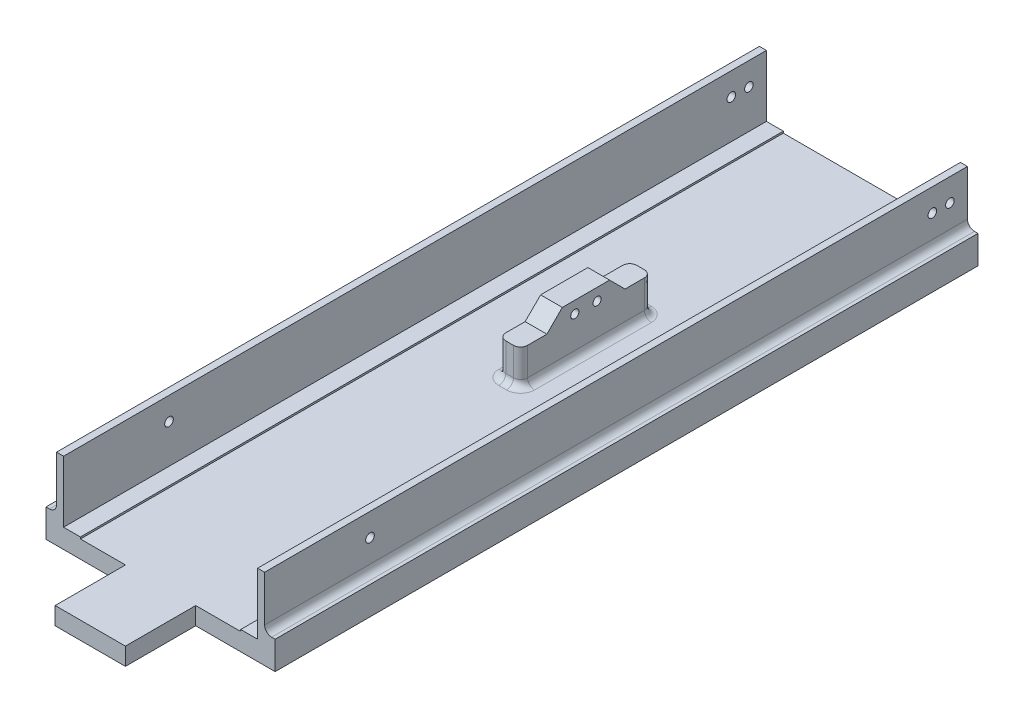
from build123d import *

# Parameters (mm, degrees)
BOSS_EXTRUDE1_DEPTH      = 400
SKETCH2_R                = 2.1
CUT_EXTRUDE3_DEPTH       = 10
SKETCH3_W                = 158.039132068
SKETCH3_H                = 497.98789011
CUT_EXTRUDE4_DEPTH       = 2
SKETCH4_W                = 4.8
SKETCH4_H                = 400
BOSS_EXTRUDE2_DEPTH      = 8
SKETCH5_R                = 1.2
CUT_EXTRUDE9_DEPTH       = 406.158043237
SKETCH9_R                = 1.225
CUT_EXTRUDE10_DEPTH      = 406.931077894
SKETCH10_W               = 4.8
SKETCH10_H               = 400
CUT_EXTRUDE11_DEPTH      = 5
BOSS_EXTRUDE3_START      = -15
SKETCH12_R               = 2.1
BOSS_EXTRUDE3_DEPTH      = 15
SKETCH13_W               = 6.18
SKETCH13_H               = 37.25
BOSS_EXTRUDE5_DEPTH      = 10
BOSS_EXTRUDE6_DEPTH      = 6.18
SKETCH15_R               = 1.05
CUT_EXTRUDE12_DEPTH      = 10
FILLET1_R                = 2
SKETCH16_W               = 4.8
SKETCH16_H               = 400
CUT_EXTRUDE13_DEPTH      = 2.5
CUT_EXTRUDE14_REACH      = 404.247
SKETCH17_R               = 1.16
CUT_EXTRUDE16_DEPTH      = 406.158043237
CUT_EXTRUDE16_DEPTH_BACK = 406.158043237
SKETCH18_R               = 1.225
CUT_EXTRUDE17_DEPTH      = 406.158043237
CUT_EXTRUDE17_DEPTH_BACK = 406.158043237
SKETCH20_R               = 1.225
SKETCH22_W               = 3
SKETCH22_H               = 15
CUT_EXTRUDE18_DEPTH      = 406.931077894
FILLET2_R                = 2
FILLET3_R                = 2
SKETCH24_W               = 3
SKETCH24_H               = 200
SKETCH24_W_2             = 2
CUT_EXTRUDE20_DEPTH      = 406.931077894


with BuildPart() as part:
    # Sketch1 → Boss-Extrude1 (new body)
    with BuildSketch(Plane.XY):
        Polygon((0, 0), (0, 25), (5, 25), (5, 5), (60.2, 5), (60.2, 25), (65.2, 25), (65.2, 0), align=None)
    extrude(amount=BOSS_EXTRUDE1_DEPTH)

    # Sketch2 → Cut-Extrude3 (cut)
    with BuildSketch(Plane(origin=(0, 5, 0), x_dir=(1, 0, 0), z_dir=(0, 1, 0))):
        with Locations(Location((32.6, -67.17, 0), (0, 0, 270))):
            Circle(SKETCH2_R)
        with Locations(Location((32.6, -96.92, 0), (0, 0, 270))):
            Circle(SKETCH2_R)
    extrude(amount=-CUT_EXTRUDE3_DEPTH, mode=Mode.SUBTRACT)

    # Sketch3 → Cut-Extrude4 (cut)
    with BuildSketch(Plane(origin=(0, 25, 0), x_dir=(1, 0, 0), z_dir=(0, 1, 0))):
        with Locations((44.123686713, -201.646240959)):
            Rectangle(SKETCH3_W, SKETCH3_H)
    extrude(amount=-CUT_EXTRUDE4_DEPTH, mode=Mode.SUBTRACT)

    # Sketch4 → Boss-Extrude2 (add)
    with BuildSketch(Plane(origin=(0, 5, 0), x_dir=(1, 0, 0), z_dir=(0, 1, 0))):
        with Locations((7.4, -200)):
            Rectangle(SKETCH4_W, SKETCH4_H)
        with Locations((57.8, -200)):
            Rectangle(SKETCH4_W, SKETCH4_H)
    extrude(amount=BOSS_EXTRUDE2_DEPTH)

    # Sketch5 → Cut-Extrude9 (cut, through all)
    with BuildSketch(Plane(origin=(5, 0, 0), x_dir=(0, 0, -1), z_dir=(1, 0, 0))):
        with Locations(Location((-395, 16.5, 0), (0, 0, 90))):
            Circle(SKETCH5_R)
        with Locations(Location((-390, 16.5, 0), (0, 0, 90))):
            Circle(SKETCH5_R)
        with Locations(Location((-10, 16.5, 0), (0, 0, 90))):
            Circle(SKETCH5_R)
        with Locations(Location((-5, 16.5, 0), (0, 0, 90))):
            Circle(SKETCH5_R)
    extrude(amount=-CUT_EXTRUDE9_DEPTH, mode=Mode.SUBTRACT)

    # Sketch9 → Cut-Extrude10 (cut, through all)
    with BuildSketch(Plane.ZY):
        with Locations((5, 16.5)):
            Circle(SKETCH9_R)
        with Locations((10, 16.5)):
            Circle(SKETCH9_R)
        with Locations((390, 16.5)):
            Circle(SKETCH9_R)
        with Locations((395, 16.5)):
            Circle(SKETCH9_R)
    extrude(amount=-CUT_EXTRUDE10_DEPTH, mode=Mode.SUBTRACT)

    # Sketch10 → Cut-Extrude11 (cut)
    with BuildSketch(Plane(origin=(0, 13, 0), x_dir=(1, 0, 0), z_dir=(0, 1, 0))):
        with Locations((7.4, -200)):
            Rectangle(SKETCH10_W, SKETCH10_H)
        with Locations((57.8, -200)):
            Rectangle(SKETCH10_W, SKETCH10_H)
    extrude(amount=-CUT_EXTRUDE11_DEPTH, mode=Mode.SUBTRACT)

    # Sketch12 → Boss-Extrude3 (add)
    with BuildSketch(Plane.XZ.offset(BOSS_EXTRUDE3_START)):
        with Locations(Location((32.6, 96.92, 0), (0, 0, 270))):
            Circle(SKETCH12_R)
        with Locations(Location((32.6, 67.17, 0), (0, 0, 270))):
            Circle(SKETCH12_R)
    extrude(amount=BOSS_EXTRUDE3_DEPTH)

    # Sketch13 → Boss-Extrude5 (add)
    with BuildSketch(Plane(origin=(0, 5, 0), x_dir=(1, 0, 0), z_dir=(0, 1, 0))):
        with Locations((32.6, -82.045)):
            Rectangle(SKETCH13_W, SKETCH13_H)
    extrude(amount=BOSS_EXTRUDE5_DEPTH)

    # Sketch14 → Boss-Extrude6 (add)
    with BuildSketch(Plane.ZY.offset(-29.51)):
        Polygon((70.92, 15), (75.32, 19.4), (88.77, 19.4), (93.17, 15), align=None)
    extrude(amount=-BOSS_EXTRUDE6_DEPTH)

    # Sketch15 → Cut-Extrude12 (cut)
    with BuildSketch(Plane.ZY.offset(-29.51)):
        with Locations((78.87, 16)):
            Circle(SKETCH15_R)
        with Locations((85.22, 16)):
            Circle(SKETCH15_R)
    extrude(amount=-CUT_EXTRUDE12_DEPTH, mode=Mode.SUBTRACT)

    # Fillet1
    fillet1_edges = [part.edges().sort_by_distance(p)[0] for p in [
        (29.51, 5, 82.045),
        (29.51, 10, 63.42),
        (32.6, 5, 100.67),
        (29.51, 10, 100.67),
        (35.69, 5, 82.045),
        (35.69, 10, 100.67),
        (32.6, 5, 63.42),
        (35.69, 10, 63.42),
    ]]
    fillet(fillet1_edges, radius=FILLET1_R)

    # Sketch16 → Cut-Extrude13 (cut)
    with BuildSketch(Plane(origin=(0, 8, 0), x_dir=(1, 0, 0), z_dir=(0, 1, 0))):
        with Locations((7.4, -200)):
            Rectangle(SKETCH16_W, SKETCH16_H)
        with Locations((57.8, -200)):
            Rectangle(SKETCH16_W, SKETCH16_H)
    extrude(amount=-CUT_EXTRUDE13_DEPTH, mode=Mode.SUBTRACT)

    # Sketch17 → Cut-Extrude14 (cut, up to next)
    with BuildSketch(Plane.ZY.offset(-29.51), mode=Mode.PRIVATE) as cut_extrude14_sk1:
        with Locations((78.87, 16)):
            Circle(SKETCH17_R)
    cut_extrude14_tool1 = extrude(cut_extrude14_sk1.sketch, amount=-CUT_EXTRUDE14_REACH, mode=Mode.PRIVATE) & part.part
    # Sketch17 → Cut-Extrude14 (cut, up to next)
    with BuildSketch(Plane.ZY.offset(-29.51), mode=Mode.PRIVATE) as cut_extrude14_sk2:
        with Locations((85.22, 16)):
            Circle(SKETCH17_R)
    cut_extrude14_tool2 = extrude(cut_extrude14_sk2.sketch, amount=-CUT_EXTRUDE14_REACH, mode=Mode.PRIVATE) & part.part
    add(cut_extrude14_tool1.solids().sort_by_distance((29.51, 16, 78.87))[0], mode=Mode.SUBTRACT)
    add(cut_extrude14_tool2.solids().sort_by_distance((29.51, 16, 85.22))[0], mode=Mode.SUBTRACT)

    # Sketch18 → Cut-Extrude16 (cut, two sides: drawn at the far end of the back side and taken through both)
    with BuildSketch(Plane.ZY.offset(-60.2).offset(-CUT_EXTRUDE16_DEPTH_BACK)):
        with Locations((170, 16.5)):
            Circle(SKETCH18_R)
    extrude(amount=CUT_EXTRUDE16_DEPTH + CUT_EXTRUDE16_DEPTH_BACK, mode=Mode.SUBTRACT)

    # Sketch20 → Cut-Extrude17 (cut, two sides: drawn at the far end of the back side and taken through both)
    with BuildSketch(Plane.ZY.offset(-60.2).offset(-CUT_EXTRUDE17_DEPTH_BACK)):
        with Locations((230, 16.5)):
            Circle(SKETCH20_R)
    extrude(amount=CUT_EXTRUDE17_DEPTH + CUT_EXTRUDE17_DEPTH_BACK, mode=Mode.SUBTRACT)

    # Sketch22 → Cut-Extrude18 (cut, through all)
    with BuildSketch(Plane(origin=(0, 0, 0), x_dir=(-1, 0, 0), z_dir=(0, 0, -1))):
        with Locations((-63.7, 15.5)):
            Rectangle(SKETCH22_W, SKETCH22_H)
        with Locations((-1.5, 15.5)):
            Rectangle(SKETCH22_W, SKETCH22_H)
    extrude(amount=-CUT_EXTRUDE18_DEPTH, mode=Mode.SUBTRACT)

    # Fillet2
    fillet2_edges = [part.edges().sort_by_distance(p)[0] for p in [
        (62.2, 8, 200),
    ]]
    fillet(fillet2_edges, radius=FILLET2_R)

    # Fillet3
    fillet3_edges = [part.edges().sort_by_distance(p)[0] for p in [
        (3, 8, 200),
    ]]
    fillet(fillet3_edges, radius=FILLET3_R)

    # Sketch24 → Cut-Extrude20 (cut, through all)
    with BuildSketch(Plane(origin=(0, 23, 0), x_dir=(1, 0, 0), z_dir=(0, 1, 0))):
        Polygon((22.6, -200), (0, -200), (0, -400), (60.2, -400), (60.2, -200), (42.6, -200), (42.6, -220), (22.6, -220), align=None)
        with Locations((63.7, -300)):
            Rectangle(SKETCH24_W, SKETCH24_H)
        with Locations((61.2, -300)):
            Rectangle(SKETCH24_W_2, SKETCH24_H)
    extrude(amount=-CUT_EXTRUDE20_DEPTH, mode=Mode.SUBTRACT)


solid = part.part
